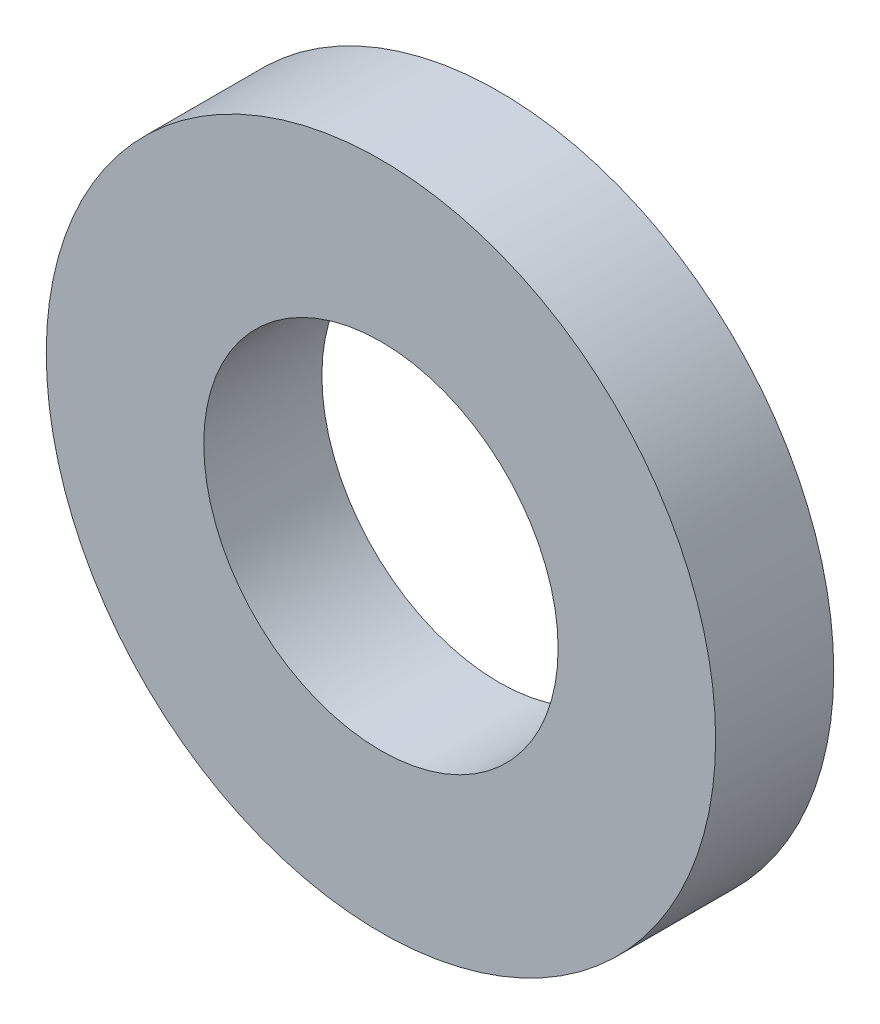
ISO-10303-21;
HEADER;
FILE_DESCRIPTION(('STEP AP214'),'2;1');
FILE_NAME('part.step','',(''),(''),'','','');
FILE_SCHEMA(('AUTOMOTIVE_DESIGN { 1 0 10303 214 1 1 1 1 }'));
ENDSEC;
DATA;
#1=APPLICATION_CONTEXT('core data for automotive mechanical design processes');
#2=APPLICATION_PROTOCOL_DEFINITION('international standard','automotive_design',2000,#1);
#3=PRODUCT_CONTEXT('',#1,'mechanical');
#4=PRODUCT('Part','Part','',(#3));
#5=PRODUCT_RELATED_PRODUCT_CATEGORY('part','',(#4));
#6=PRODUCT_DEFINITION_FORMATION('','',#4);
#7=PRODUCT_DEFINITION_CONTEXT('part definition',#1,'design');
#8=PRODUCT_DEFINITION('design','',#6,#7);
#9=PRODUCT_DEFINITION_SHAPE('','',#8);
#10=(LENGTH_UNIT() NAMED_UNIT(*) SI_UNIT(.MILLI.,.METRE.));
#11=(NAMED_UNIT(*) PLANE_ANGLE_UNIT() SI_UNIT($,.RADIAN.));
#12=(NAMED_UNIT(*) SI_UNIT($,.STERADIAN.) SOLID_ANGLE_UNIT());
#13=UNCERTAINTY_MEASURE_WITH_UNIT(LENGTH_MEASURE(1.E-05),#10,'distance_accuracy_value','');
#14=(GEOMETRIC_REPRESENTATION_CONTEXT(3) GLOBAL_UNCERTAINTY_ASSIGNED_CONTEXT((#13)) GLOBAL_UNIT_ASSIGNED_CONTEXT((#10,
#11,#12)) REPRESENTATION_CONTEXT('',''));
#15=CARTESIAN_POINT('',(0.,0.,0.));
#16=DIRECTION('',(0.,0.,1.));
#17=DIRECTION('',(1.,0.,0.));
#18=AXIS2_PLACEMENT_3D('',#15,#16,#17);
#19=CARTESIAN_POINT('',(0.,0.,1.5));
#20=DIRECTION('',(0.,0.,1.));
#21=DIRECTION('',(1.,0.,0.));
#22=AXIS2_PLACEMENT_3D('',#19,#20,#21);
#23=PLANE('',#22);
#24=CARTESIAN_POINT('',(0.,0.,1.5));
#25=DIRECTION('',(0.,0.,1.));
#26=DIRECTION('',(1.,0.,0.));
#27=AXIS2_PLACEMENT_3D('',#24,#25,#26);
#28=CIRCLE('',#27,4.25);
#29=CARTESIAN_POINT('',(4.25,0.,1.5));
#30=VERTEX_POINT('',#29);
#31=EDGE_CURVE('E11',#30,#30,#28,.T.);
#32=ORIENTED_EDGE('',*,*,#31,.T.);
#33=EDGE_LOOP('',(#32));
#34=FACE_BOUND('',#33,.T.);
#35=CARTESIAN_POINT('',(0.,0.,1.5));
#36=DIRECTION('',(0.,0.,1.));
#37=DIRECTION('',(1.,0.,0.));
#38=AXIS2_PLACEMENT_3D('',#35,#36,#37);
#39=CIRCLE('',#38,2.25);
#40=CARTESIAN_POINT('',(2.25,0.,1.5));
#41=VERTEX_POINT('',#40);
#42=EDGE_CURVE('E48',#41,#41,#39,.T.);
#43=ORIENTED_EDGE('',*,*,#42,.F.);
#44=EDGE_LOOP('',(#43));
#45=FACE_BOUND('',#44,.T.);
#46=ADVANCED_FACE('F37',(#34,#45),#23,.T.);
#47=CARTESIAN_POINT('',(0.,0.,0.));
#48=DIRECTION('',(0.,0.,1.));
#49=DIRECTION('',(1.,0.,0.));
#50=AXIS2_PLACEMENT_3D('',#47,#48,#49);
#51=PLANE('',#50);
#52=CARTESIAN_POINT('',(0.,0.,0.));
#53=DIRECTION('',(0.,0.,1.));
#54=DIRECTION('',(1.,0.,0.));
#55=AXIS2_PLACEMENT_3D('',#52,#53,#54);
#56=CIRCLE('',#55,4.25);
#57=CARTESIAN_POINT('',(4.25,0.,0.));
#58=VERTEX_POINT('',#57);
#59=EDGE_CURVE('E41',#58,#58,#56,.T.);
#60=ORIENTED_EDGE('',*,*,#59,.F.);
#61=EDGE_LOOP('',(#60));
#62=FACE_BOUND('',#61,.T.);
#63=CARTESIAN_POINT('',(0.,0.,0.));
#64=DIRECTION('',(0.,0.,1.));
#65=DIRECTION('',(1.,0.,0.));
#66=AXIS2_PLACEMENT_3D('',#63,#64,#65);
#67=CIRCLE('',#66,2.25);
#68=CARTESIAN_POINT('',(2.25,0.,0.));
#69=VERTEX_POINT('',#68);
#70=EDGE_CURVE('E50',#69,#69,#67,.T.);
#71=ORIENTED_EDGE('',*,*,#70,.T.);
#72=EDGE_LOOP('',(#71));
#73=FACE_BOUND('',#72,.T.);
#74=ADVANCED_FACE('F60',(#62,#73),#51,.F.);
#75=CARTESIAN_POINT('',(0.,0.,1.5));
#76=DIRECTION('',(0.,0.,-1.));
#77=DIRECTION('',(-1.,0.,0.));
#78=AXIS2_PLACEMENT_3D('',#75,#76,#77);
#79=CYLINDRICAL_SURFACE('',#78,4.25);
#80=ORIENTED_EDGE('',*,*,#31,.F.);
#81=EDGE_LOOP('',(#80));
#82=FACE_BOUND('',#81,.T.);
#83=ORIENTED_EDGE('',*,*,#59,.T.);
#84=EDGE_LOOP('',(#83));
#85=FACE_BOUND('',#84,.T.);
#86=ADVANCED_FACE('F39',(#82,#85),#79,.T.);
#87=CARTESIAN_POINT('',(0.,0.,1.5));
#88=DIRECTION('',(0.,0.,-1.));
#89=DIRECTION('',(-1.,0.,0.));
#90=AXIS2_PLACEMENT_3D('',#87,#88,#89);
#91=CYLINDRICAL_SURFACE('',#90,2.25);
#92=ORIENTED_EDGE('',*,*,#42,.T.);
#93=EDGE_LOOP('',(#92));
#94=FACE_BOUND('',#93,.T.);
#95=ORIENTED_EDGE('',*,*,#70,.F.);
#96=EDGE_LOOP('',(#95));
#97=FACE_BOUND('',#96,.T.);
#98=ADVANCED_FACE('F56',(#94,#97),#91,.F.);
#99=CLOSED_SHELL('',(#46,#74,#86,#98));
#100=MANIFOLD_SOLID_BREP('B2',#99);
#101=ADVANCED_BREP_SHAPE_REPRESENTATION('',(#18,#100),#14);
#102=SHAPE_DEFINITION_REPRESENTATION(#9,#101);
ENDSEC;
END-ISO-10303-21;
